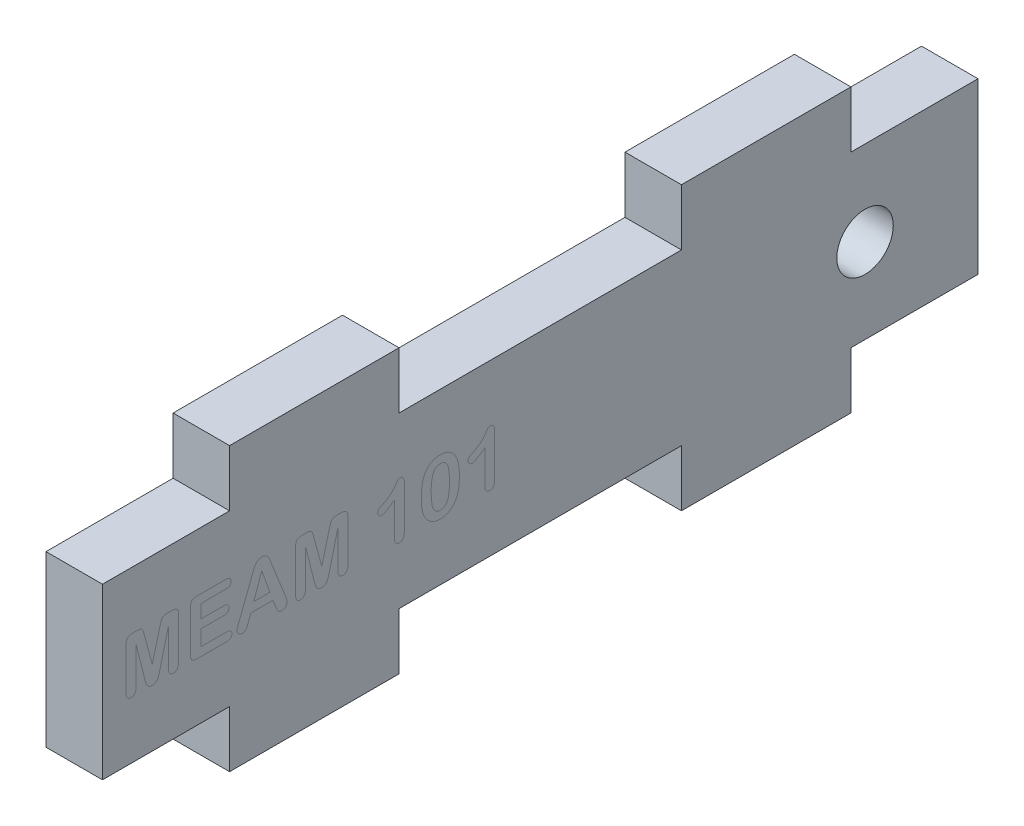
from build123d import *

# Parameters (mm, degrees)
SKETCH1_W           = 98.425
SKETCH1_H           = 19.05
BOSS_EXTRUDE1_DEPTH = 3.175
SKETCH2_W           = 19.05
SKETCH2_H           = 6.35
BOSS_EXTRUDE2_DEPTH = 6.35
SKETCH3_R           = 3.175
CUT_EXTRUDE1_DEPTH  = 6.35


with BuildPart() as part:
    # Sketch1 → Boss-Extrude1 (new, symmetric)
    with BuildSketch(Plane(origin=(0, 0, 0), x_dir=(0, 0, -1), z_dir=(1, 0, 0))):
        Rectangle(SKETCH1_W, SKETCH1_H)
    extrude(amount=BOSS_EXTRUDE1_DEPTH, both=True)

    # Sketch2 → Boss-Extrude2 (add)
    with BuildSketch(Plane(origin=(3.175, 0, 0), x_dir=(0, 0, -1), z_dir=(1, 0, 0))):
        with Locations((-25.4, 12.7)):
            Rectangle(SKETCH2_W, SKETCH2_H)
        with Locations((25.4, 12.7)):
            Rectangle(SKETCH2_W, SKETCH2_H)
    boss_extrude2 = extrude(amount=-BOSS_EXTRUDE2_DEPTH)

    # Mirror1: Boss-Extrude2 across plane
    add(boss_extrude2.mirror(Plane.ZX))

    # Sketch3 → Cut-Extrude1 (cut)
    with BuildSketch(Plane(origin=(3.175, 0, 0), x_dir=(0, 0, -1), z_dir=(1, 0, 0))):
        with Locations((36.5125, 0)):
            Circle(SKETCH3_R)
    extrude(amount=-CUT_EXTRUDE1_DEPTH, mode=Mode.SUBTRACT)


solid = part.part
